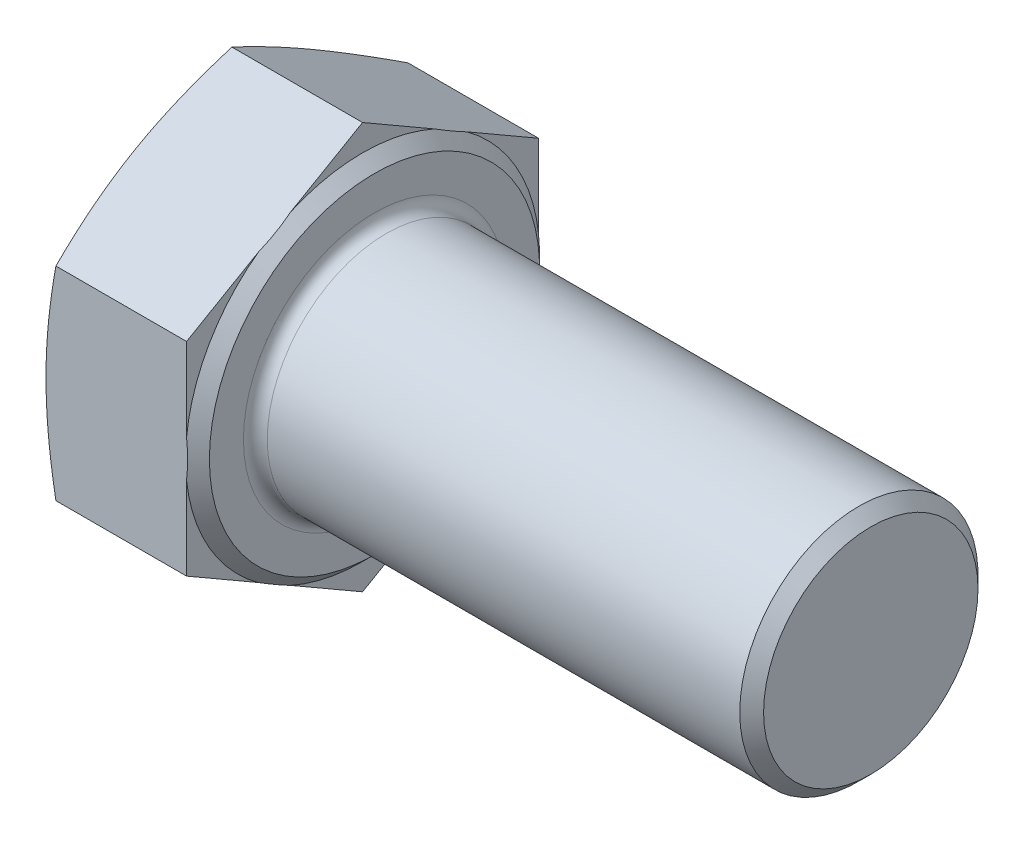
from build123d import *

# Parameters (mm, degrees)
BASEHEAD_DEPTH = 7.68
SKETCH5_R      = 6
BASEBODY_DEPTH = 25
CHAMFER1_SIZE  = 0.6
HEADFILLET_R   = 0.6


with BuildPart() as part:
    # Sketch2 → BaseHead (new body)
    with BuildSketch(Plane(origin=(0, 0, 0), x_dir=(0, 0, -1), z_dir=(1, 0, 0))):
        Polygon((8.865, -5.118210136), (8.865, 5.118210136), (0, 10.236420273), (-8.865, 5.118210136), (-8.865, -5.118210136), (0, -10.236420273), align=None)
    extrude(amount=BASEHEAD_DEPTH)

    # Sketch3 → BearingFace (revolve, cut)
    with BuildSketch(Plane.XY, mode=Mode.PRIVATE) as bearingface_sk:
        Polygon((7.68, 10.236420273), (7.68, 8.315), (7.08, 8.915), (7.08, 10.236420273), align=None)
    revolve(bearingface_sk.sketch.rotate(Axis((-0.957090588, 0, 0), (1, 0, 0)), 90), axis=Axis((-0.957090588, 0, 0), (1, 0, 0)), mode=Mode.SUBTRACT)

    # Sketch4 → HeadChamfer (revolve, cut)
    with BuildSketch(Plane.XY):
        Polygon((0, 10.236420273), (0.499156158, 10.236420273), (0, 8.865), align=None)
    revolve(axis=Axis((-0.493528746, 0, 0), (1, 0, 0)), mode=Mode.SUBTRACT)

    # Sketch5 → BaseBody (add)
    with BuildSketch(Plane(origin=(7.68, 0, 0), x_dir=(0, 0, -1), z_dir=(1, 0, 0))):
        Circle(SKETCH5_R)
    extrude(amount=BASEBODY_DEPTH)

    # Chamfer1
    chamfer1_edges = [part.edges().sort_by_distance(p)[0] for p in [
        (32.68, 0, 6),
    ]]
    chamfer(chamfer1_edges, length=CHAMFER1_SIZE)

    # HeadFillet
    headfillet_edges = [part.edges().sort_by_distance(p)[0] for p in [
        (7.68, 0, 6),
    ]]
    fillet(headfillet_edges, radius=HEADFILLET_R)


solid = part.part
